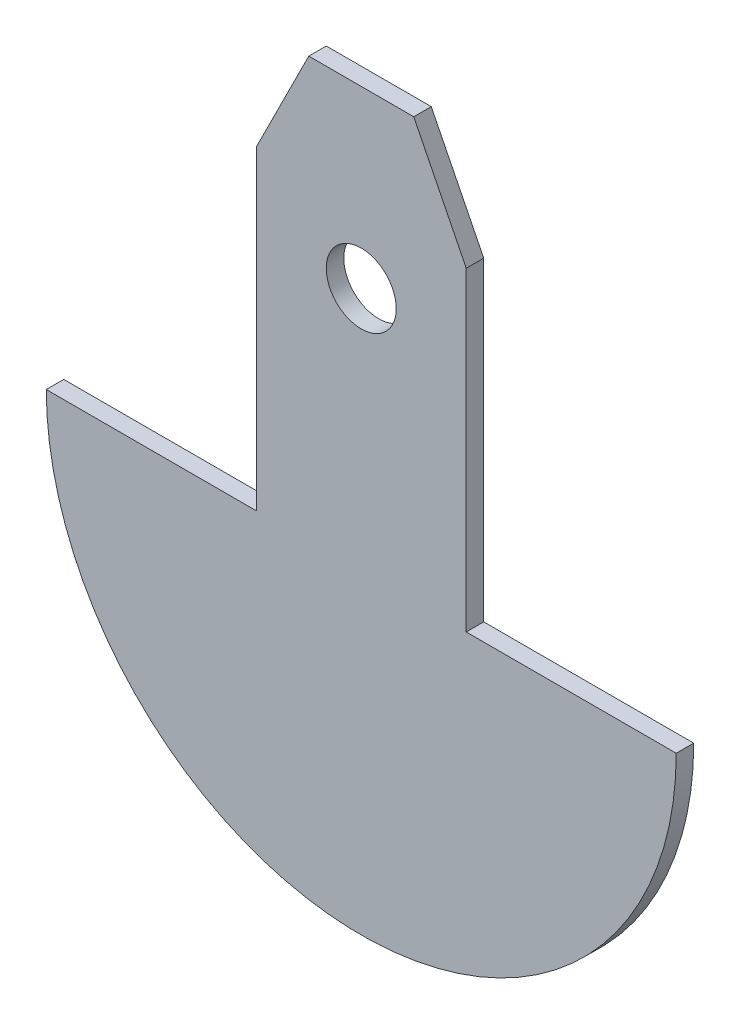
ISO-10303-21;
HEADER;
FILE_DESCRIPTION(('STEP AP214'),'2;1');
FILE_NAME('part.step','',(''),(''),'','','');
FILE_SCHEMA(('AUTOMOTIVE_DESIGN { 1 0 10303 214 1 1 1 1 }'));
ENDSEC;
DATA;
#1=APPLICATION_CONTEXT('core data for automotive mechanical design processes');
#2=APPLICATION_PROTOCOL_DEFINITION('international standard','automotive_design',2000,#1);
#3=PRODUCT_CONTEXT('',#1,'mechanical');
#4=PRODUCT('Part','Part','',(#3));
#5=PRODUCT_RELATED_PRODUCT_CATEGORY('part','',(#4));
#6=PRODUCT_DEFINITION_FORMATION('','',#4);
#7=PRODUCT_DEFINITION_CONTEXT('part definition',#1,'design');
#8=PRODUCT_DEFINITION('design','',#6,#7);
#9=PRODUCT_DEFINITION_SHAPE('','',#8);
#10=(LENGTH_UNIT() NAMED_UNIT(*) SI_UNIT(.MILLI.,.METRE.));
#11=(NAMED_UNIT(*) PLANE_ANGLE_UNIT() SI_UNIT($,.RADIAN.));
#12=(NAMED_UNIT(*) SI_UNIT($,.STERADIAN.) SOLID_ANGLE_UNIT());
#13=UNCERTAINTY_MEASURE_WITH_UNIT(LENGTH_MEASURE(1.E-05),#10,'distance_accuracy_value','');
#14=(GEOMETRIC_REPRESENTATION_CONTEXT(3) GLOBAL_UNCERTAINTY_ASSIGNED_CONTEXT((#13)) GLOBAL_UNIT_ASSIGNED_CONTEXT((#10,
#11,#12)) REPRESENTATION_CONTEXT('',''));
#15=CARTESIAN_POINT('',(0.,0.,0.));
#16=DIRECTION('',(0.,0.,1.));
#17=DIRECTION('',(1.,0.,0.));
#18=AXIS2_PLACEMENT_3D('',#15,#16,#17);
#19=CARTESIAN_POINT('',(114.3,0.,6.35));
#20=DIRECTION('',(0.,0.,-1.));
#21=DIRECTION('',(-1.,0.,0.));
#22=AXIS2_PLACEMENT_3D('',#19,#20,#21);
#23=CYLINDRICAL_SURFACE('',#22,114.3);
#24=CARTESIAN_POINT('',(114.3,0.,0.));
#25=DIRECTION('',(0.,0.,1.));
#26=DIRECTION('',(1.,0.,0.));
#27=AXIS2_PLACEMENT_3D('',#24,#25,#26);
#28=CIRCLE('',#27,114.3);
#29=CARTESIAN_POINT('',(0.,0.,0.));
#30=VERTEX_POINT('',#29);
#31=CARTESIAN_POINT('',(228.6,0.,0.));
#32=VERTEX_POINT('',#31);
#33=EDGE_CURVE('E127',#30,#32,#28,.T.);
#34=ORIENTED_EDGE('',*,*,#33,.T.);
#35=DIRECTION('',(0.,0.,-1.));
#36=VECTOR('',#35,1.);
#37=CARTESIAN_POINT('',(228.6,0.,6.35));
#38=LINE('',#37,#36);
#39=CARTESIAN_POINT('',(228.6,0.,6.35));
#40=VERTEX_POINT('',#39);
#41=EDGE_CURVE('E11',#40,#32,#38,.T.);
#42=ORIENTED_EDGE('',*,*,#41,.F.);
#43=CARTESIAN_POINT('',(114.3,0.,6.35));
#44=DIRECTION('',(0.,0.,1.));
#45=DIRECTION('',(1.,0.,0.));
#46=AXIS2_PLACEMENT_3D('',#43,#44,#45);
#47=CIRCLE('',#46,114.3);
#48=CARTESIAN_POINT('',(0.,0.,6.35));
#49=VERTEX_POINT('',#48);
#50=EDGE_CURVE('E143',#49,#40,#47,.T.);
#51=ORIENTED_EDGE('',*,*,#50,.F.);
#52=DIRECTION('',(0.,0.,-1.));
#53=VECTOR('',#52,1.);
#54=CARTESIAN_POINT('',(0.,0.,6.35));
#55=LINE('',#54,#53);
#56=EDGE_CURVE('E123',#49,#30,#55,.T.);
#57=ORIENTED_EDGE('',*,*,#56,.T.);
#58=EDGE_LOOP('',(#34,#42,#51,#57));
#59=FACE_BOUND('',#58,.T.);
#60=ADVANCED_FACE('F31',(#59),#23,.T.);
#61=CARTESIAN_POINT('',(152.4,0.,6.35));
#62=DIRECTION('',(0.,-1.,0.));
#63=DIRECTION('',(0.,0.,-1.));
#64=AXIS2_PLACEMENT_3D('',#61,#62,#63);
#65=PLANE('',#64);
#66=DIRECTION('',(-1.,0.,0.));
#67=VECTOR('',#66,1.);
#68=CARTESIAN_POINT('',(152.4,0.,0.));
#69=LINE('',#68,#67);
#70=CARTESIAN_POINT('',(152.4,0.,0.));
#71=VERTEX_POINT('',#70);
#72=EDGE_CURVE('E130',#32,#71,#69,.T.);
#73=ORIENTED_EDGE('',*,*,#72,.T.);
#74=DIRECTION('',(0.,0.,-1.));
#75=VECTOR('',#74,1.);
#76=CARTESIAN_POINT('',(152.4,0.,6.35));
#77=LINE('',#76,#75);
#78=CARTESIAN_POINT('',(152.4,0.,6.35));
#79=VERTEX_POINT('',#78);
#80=EDGE_CURVE('E39',#79,#71,#77,.T.);
#81=ORIENTED_EDGE('',*,*,#80,.F.);
#82=DIRECTION('',(-1.,0.,0.));
#83=VECTOR('',#82,1.);
#84=CARTESIAN_POINT('',(152.4,0.,6.35));
#85=LINE('',#84,#83);
#86=EDGE_CURVE('E90',#40,#79,#85,.T.);
#87=ORIENTED_EDGE('',*,*,#86,.F.);
#88=ORIENTED_EDGE('',*,*,#41,.T.);
#89=EDGE_LOOP('',(#73,#81,#87,#88));
#90=FACE_BOUND('',#89,.T.);
#91=ADVANCED_FACE('F198',(#90),#65,.F.);
#92=CARTESIAN_POINT('',(152.4,114.3,6.35));
#93=DIRECTION('',(-1.,0.,0.));
#94=DIRECTION('',(0.,-1.,0.));
#95=AXIS2_PLACEMENT_3D('',#92,#93,#94);
#96=PLANE('',#95);
#97=DIRECTION('',(0.,1.,0.));
#98=VECTOR('',#97,1.);
#99=CARTESIAN_POINT('',(152.4,114.3,0.));
#100=LINE('',#99,#98);
#101=CARTESIAN_POINT('',(152.4,114.3,0.));
#102=VERTEX_POINT('',#101);
#103=EDGE_CURVE('E133',#71,#102,#100,.T.);
#104=ORIENTED_EDGE('',*,*,#103,.T.);
#105=DIRECTION('',(0.,0.,-1.));
#106=VECTOR('',#105,1.);
#107=CARTESIAN_POINT('',(152.4,114.3,6.35));
#108=LINE('',#107,#106);
#109=CARTESIAN_POINT('',(152.4,114.3,6.35));
#110=VERTEX_POINT('',#109);
#111=EDGE_CURVE('E150',#110,#102,#108,.T.);
#112=ORIENTED_EDGE('',*,*,#111,.F.);
#113=DIRECTION('',(0.,1.,0.));
#114=VECTOR('',#113,1.);
#115=CARTESIAN_POINT('',(152.4,114.3,6.35));
#116=LINE('',#115,#114);
#117=EDGE_CURVE('E158',#79,#110,#116,.T.);
#118=ORIENTED_EDGE('',*,*,#117,.F.);
#119=ORIENTED_EDGE('',*,*,#80,.T.);
#120=EDGE_LOOP('',(#104,#112,#118,#119));
#121=FACE_BOUND('',#120,.T.);
#122=ADVANCED_FACE('F156',(#121),#96,.F.);
#123=CARTESIAN_POINT('',(133.35,152.4,6.35));
#124=DIRECTION('',(-0.894427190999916,-0.447213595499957,0.));
#125=DIRECTION('',(0.447213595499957,-0.894427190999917,0.));
#126=AXIS2_PLACEMENT_3D('',#123,#124,#125);
#127=PLANE('',#126);
#128=DIRECTION('',(-0.447213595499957,0.894427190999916,0.));
#129=VECTOR('',#128,1.);
#130=CARTESIAN_POINT('',(133.35,152.4,0.));
#131=LINE('',#130,#129);
#132=CARTESIAN_POINT('',(133.35,152.4,0.));
#133=VERTEX_POINT('',#132);
#134=EDGE_CURVE('E135',#102,#133,#131,.T.);
#135=ORIENTED_EDGE('',*,*,#134,.T.);
#136=DIRECTION('',(0.,0.,-1.));
#137=VECTOR('',#136,1.);
#138=CARTESIAN_POINT('',(133.35,152.4,6.35));
#139=LINE('',#138,#137);
#140=CARTESIAN_POINT('',(133.35,152.4,6.35));
#141=VERTEX_POINT('',#140);
#142=EDGE_CURVE('E147',#141,#133,#139,.T.);
#143=ORIENTED_EDGE('',*,*,#142,.F.);
#144=DIRECTION('',(-0.447213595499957,0.894427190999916,0.));
#145=VECTOR('',#144,1.);
#146=CARTESIAN_POINT('',(133.35,152.4,6.35));
#147=LINE('',#146,#145);
#148=EDGE_CURVE('E169',#110,#141,#147,.T.);
#149=ORIENTED_EDGE('',*,*,#148,.F.);
#150=ORIENTED_EDGE('',*,*,#111,.T.);
#151=EDGE_LOOP('',(#135,#143,#149,#150));
#152=FACE_BOUND('',#151,.T.);
#153=ADVANCED_FACE('F165',(#152),#127,.F.);
#154=CARTESIAN_POINT('',(114.3,152.4,6.35));
#155=DIRECTION('',(0.,-1.,0.));
#156=DIRECTION('',(0.,0.,-1.));
#157=AXIS2_PLACEMENT_3D('',#154,#155,#156);
#158=PLANE('',#157);
#159=DIRECTION('',(-1.,0.,0.));
#160=VECTOR('',#159,1.);
#161=CARTESIAN_POINT('',(114.3,152.4,0.));
#162=LINE('',#161,#160);
#163=CARTESIAN_POINT('',(95.25,152.4,0.));
#164=VERTEX_POINT('',#163);
#165=EDGE_CURVE('E138',#133,#164,#162,.T.);
#166=ORIENTED_EDGE('',*,*,#165,.T.);
#167=DIRECTION('',(0.,0.,-1.));
#168=VECTOR('',#167,1.);
#169=CARTESIAN_POINT('',(95.25,152.4,6.35));
#170=LINE('',#169,#168);
#171=CARTESIAN_POINT('',(95.25,152.4,6.35));
#172=VERTEX_POINT('',#171);
#173=EDGE_CURVE('E118',#172,#164,#170,.T.);
#174=ORIENTED_EDGE('',*,*,#173,.F.);
#175=DIRECTION('',(-1.,0.,0.));
#176=VECTOR('',#175,1.);
#177=CARTESIAN_POINT('',(114.3,152.4,6.35));
#178=LINE('',#177,#176);
#179=EDGE_CURVE('E109',#141,#172,#178,.T.);
#180=ORIENTED_EDGE('',*,*,#179,.F.);
#181=ORIENTED_EDGE('',*,*,#142,.T.);
#182=EDGE_LOOP('',(#166,#174,#180,#181));
#183=FACE_BOUND('',#182,.T.);
#184=ADVANCED_FACE('F168',(#183),#158,.F.);
#185=CARTESIAN_POINT('',(76.2,114.3,6.35));
#186=DIRECTION('',(0.894427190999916,-0.447213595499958,0.));
#187=DIRECTION('',(0.447213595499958,0.894427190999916,0.));
#188=AXIS2_PLACEMENT_3D('',#185,#186,#187);
#189=PLANE('',#188);
#190=DIRECTION('',(-0.447213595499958,-0.894427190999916,0.));
#191=VECTOR('',#190,1.);
#192=CARTESIAN_POINT('',(76.2,114.3,0.));
#193=LINE('',#192,#191);
#194=CARTESIAN_POINT('',(76.2,114.3,0.));
#195=VERTEX_POINT('',#194);
#196=EDGE_CURVE('E117',#164,#195,#193,.T.);
#197=ORIENTED_EDGE('',*,*,#196,.T.);
#198=DIRECTION('',(0.,0.,-1.));
#199=VECTOR('',#198,1.);
#200=CARTESIAN_POINT('',(76.2,114.3,6.35));
#201=LINE('',#200,#199);
#202=CARTESIAN_POINT('',(76.2,114.3,6.35));
#203=VERTEX_POINT('',#202);
#204=EDGE_CURVE('E114',#203,#195,#201,.T.);
#205=ORIENTED_EDGE('',*,*,#204,.F.);
#206=DIRECTION('',(-0.447213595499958,-0.894427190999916,0.));
#207=VECTOR('',#206,1.);
#208=CARTESIAN_POINT('',(76.2,114.3,6.35));
#209=LINE('',#208,#207);
#210=EDGE_CURVE('E103',#172,#203,#209,.T.);
#211=ORIENTED_EDGE('',*,*,#210,.F.);
#212=ORIENTED_EDGE('',*,*,#173,.T.);
#213=EDGE_LOOP('',(#197,#205,#211,#212));
#214=FACE_BOUND('',#213,.T.);
#215=ADVANCED_FACE('F115',(#214),#189,.F.);
#216=CARTESIAN_POINT('',(76.2,114.3,6.35));
#217=DIRECTION('',(1.,0.,0.));
#218=DIRECTION('',(0.,0.,-1.));
#219=AXIS2_PLACEMENT_3D('',#216,#217,#218);
#220=PLANE('',#219);
#221=DIRECTION('',(0.,-1.,0.));
#222=VECTOR('',#221,1.);
#223=CARTESIAN_POINT('',(76.2,114.3,0.));
#224=LINE('',#223,#222);
#225=CARTESIAN_POINT('',(76.2,0.,0.));
#226=VERTEX_POINT('',#225);
#227=EDGE_CURVE('E76',#195,#226,#224,.T.);
#228=ORIENTED_EDGE('',*,*,#227,.T.);
#229=DIRECTION('',(0.,0.,-1.));
#230=VECTOR('',#229,1.);
#231=CARTESIAN_POINT('',(76.2,0.,6.35));
#232=LINE('',#231,#230);
#233=CARTESIAN_POINT('',(76.2,0.,6.35));
#234=VERTEX_POINT('',#233);
#235=EDGE_CURVE('E119',#234,#226,#232,.T.);
#236=ORIENTED_EDGE('',*,*,#235,.F.);
#237=DIRECTION('',(0.,-1.,0.));
#238=VECTOR('',#237,1.);
#239=CARTESIAN_POINT('',(76.2,114.3,6.35));
#240=LINE('',#239,#238);
#241=EDGE_CURVE('E107',#203,#234,#240,.T.);
#242=ORIENTED_EDGE('',*,*,#241,.F.);
#243=ORIENTED_EDGE('',*,*,#204,.T.);
#244=EDGE_LOOP('',(#228,#236,#242,#243));
#245=FACE_BOUND('',#244,.T.);
#246=ADVANCED_FACE('F121',(#245),#220,.F.);
#247=CARTESIAN_POINT('',(76.2,0.,6.35));
#248=DIRECTION('',(0.,-1.,0.));
#249=DIRECTION('',(0.,0.,-1.));
#250=AXIS2_PLACEMENT_3D('',#247,#248,#249);
#251=PLANE('',#250);
#252=DIRECTION('',(-1.,0.,0.));
#253=VECTOR('',#252,1.);
#254=CARTESIAN_POINT('',(76.2,0.,0.));
#255=LINE('',#254,#253);
#256=EDGE_CURVE('E82',#226,#30,#255,.T.);
#257=ORIENTED_EDGE('',*,*,#256,.T.);
#258=ORIENTED_EDGE('',*,*,#56,.F.);
#259=DIRECTION('',(-1.,0.,0.));
#260=VECTOR('',#259,1.);
#261=CARTESIAN_POINT('',(76.2,0.,6.35));
#262=LINE('',#261,#260);
#263=EDGE_CURVE('E47',#234,#49,#262,.T.);
#264=ORIENTED_EDGE('',*,*,#263,.F.);
#265=ORIENTED_EDGE('',*,*,#235,.T.);
#266=EDGE_LOOP('',(#257,#258,#264,#265));
#267=FACE_BOUND('',#266,.T.);
#268=ADVANCED_FACE('F189',(#267),#251,.F.);
#269=CARTESIAN_POINT('',(114.3,0.,6.35));
#270=DIRECTION('',(0.,0.,1.));
#271=DIRECTION('',(1.,0.,0.));
#272=AXIS2_PLACEMENT_3D('',#269,#270,#271);
#273=PLANE('',#272);
#274=CARTESIAN_POINT('',(114.3,88.9,6.35));
#275=DIRECTION('',(0.,0.,1.));
#276=DIRECTION('',(1.,0.,0.));
#277=AXIS2_PLACEMENT_3D('',#274,#275,#276);
#278=CIRCLE('',#277,12.7);
#279=CARTESIAN_POINT('',(127.,88.9,6.35));
#280=VERTEX_POINT('',#279);
#281=EDGE_CURVE('E175',#280,#280,#278,.T.);
#282=ORIENTED_EDGE('',*,*,#281,.F.);
#283=EDGE_LOOP('',(#282));
#284=FACE_BOUND('',#283,.T.);
#285=ORIENTED_EDGE('',*,*,#50,.T.);
#286=ORIENTED_EDGE('',*,*,#86,.T.);
#287=ORIENTED_EDGE('',*,*,#117,.T.);
#288=ORIENTED_EDGE('',*,*,#148,.T.);
#289=ORIENTED_EDGE('',*,*,#179,.T.);
#290=ORIENTED_EDGE('',*,*,#210,.T.);
#291=ORIENTED_EDGE('',*,*,#241,.T.);
#292=ORIENTED_EDGE('',*,*,#263,.T.);
#293=EDGE_LOOP('',(#285,#286,#287,#288,#289,#290,#291,#292));
#294=FACE_BOUND('',#293,.T.);
#295=ADVANCED_FACE('F105',(#284,#294),#273,.T.);
#296=CARTESIAN_POINT('',(114.3,0.,0.));
#297=DIRECTION('',(0.,0.,1.));
#298=DIRECTION('',(1.,0.,0.));
#299=AXIS2_PLACEMENT_3D('',#296,#297,#298);
#300=PLANE('',#299);
#301=CARTESIAN_POINT('',(114.3,88.9,0.));
#302=DIRECTION('',(0.,0.,1.));
#303=DIRECTION('',(1.,0.,0.));
#304=AXIS2_PLACEMENT_3D('',#301,#302,#303);
#305=CIRCLE('',#304,12.7);
#306=CARTESIAN_POINT('',(127.,88.9,0.));
#307=VERTEX_POINT('',#306);
#308=EDGE_CURVE('E131',#307,#307,#305,.T.);
#309=ORIENTED_EDGE('',*,*,#308,.T.);
#310=EDGE_LOOP('',(#309));
#311=FACE_BOUND('',#310,.T.);
#312=ORIENTED_EDGE('',*,*,#33,.F.);
#313=ORIENTED_EDGE('',*,*,#256,.F.);
#314=ORIENTED_EDGE('',*,*,#227,.F.);
#315=ORIENTED_EDGE('',*,*,#196,.F.);
#316=ORIENTED_EDGE('',*,*,#165,.F.);
#317=ORIENTED_EDGE('',*,*,#134,.F.);
#318=ORIENTED_EDGE('',*,*,#103,.F.);
#319=ORIENTED_EDGE('',*,*,#72,.F.);
#320=EDGE_LOOP('',(#312,#313,#314,#315,#316,#317,#318,#319));
#321=FACE_BOUND('',#320,.T.);
#322=ADVANCED_FACE('F162',(#311,#321),#300,.F.);
#323=CARTESIAN_POINT('',(114.3,88.9,0.));
#324=DIRECTION('',(0.,0.,1.));
#325=DIRECTION('',(1.,0.,0.));
#326=AXIS2_PLACEMENT_3D('',#323,#324,#325);
#327=CYLINDRICAL_SURFACE('',#326,12.7);
#328=ORIENTED_EDGE('',*,*,#308,.F.);
#329=EDGE_LOOP('',(#328));
#330=FACE_BOUND('',#329,.T.);
#331=ORIENTED_EDGE('',*,*,#281,.T.);
#332=EDGE_LOOP('',(#331));
#333=FACE_BOUND('',#332,.T.);
#334=ADVANCED_FACE('F182',(#330,#333),#327,.F.);
#335=CLOSED_SHELL('',(#60,#91,#122,#153,#184,#215,#246,#268,#295,#322,#334));
#336=MANIFOLD_SOLID_BREP('B2',#335);
#337=ADVANCED_BREP_SHAPE_REPRESENTATION('',(#18,#336),#14);
#338=SHAPE_DEFINITION_REPRESENTATION(#9,#337);
ENDSEC;
END-ISO-10303-21;
